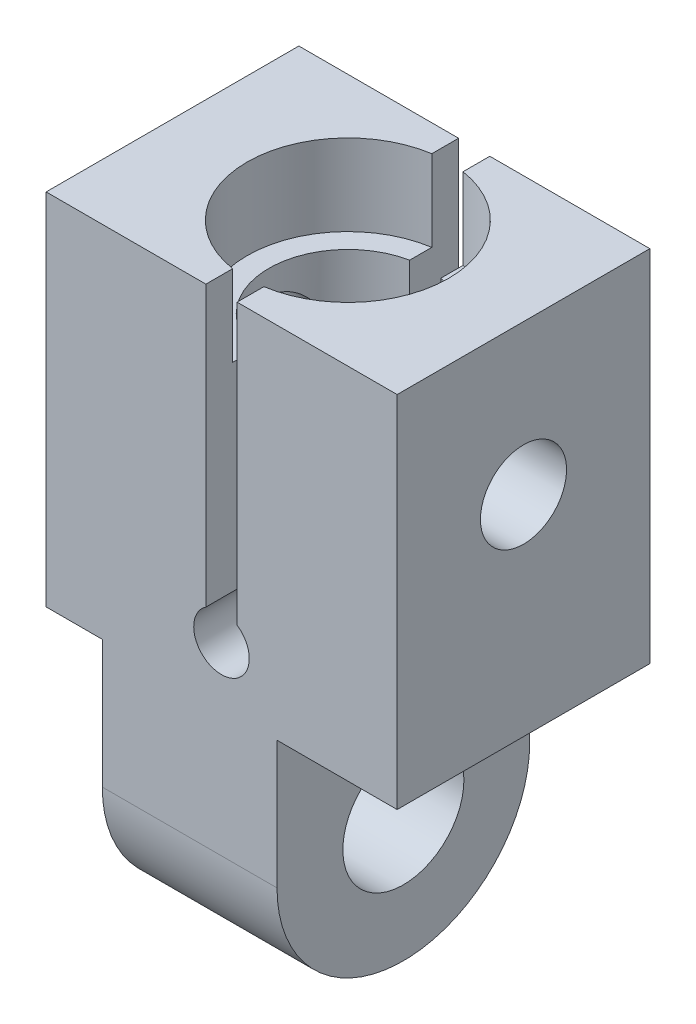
from build123d import *

# Parameters (mm, degrees)
SKETCH_1_R          = 2.4638
EXTRUDE_1_DEPTH     = 3.556
SKETCH_2_W          = 14.2875
SKETCH_2_H          = 10.287
EXTRUDE_2_DEPTH     = 14.6304
CUT_EXTRUDE_1_DEPTH = 24.88872705


with BuildPart() as part:
    # Sketch 1 → Extrude 1 (new, symmetric)
    with BuildSketch(Plane(origin=(0, 0, 0), x_dir=(0, 0, -1), z_dir=(1, 0, 0))):
        with BuildLine():
            Line((-5.1435, 0), (-5.1435, 5.207))
            Line((-5.1435, 5.207), (5.1435, 5.207))
            Line((5.1435, 5.207), (5.1435, 0))
            ThreePointArc((5.1435, 0), (0, -5.1435), (-5.1435, 0))
        make_face()
        Circle(SKETCH_1_R, mode=Mode.SUBTRACT)
    extrude(amount=EXTRUDE_1_DEPTH, both=True)

    # Sketch 2 → Extrude 2 (add)
    with BuildSketch(Plane(origin=(0, 5.207, 0), x_dir=(1, 0, 0), z_dir=(0, 1, 0))):
        with Locations((1.30175, 0)):
            Rectangle(SKETCH_2_W, SKETCH_2_H)
    extrude(amount=EXTRUDE_2_DEPTH)

    # Sketch 3 → Cut-Revolve 1 (revolve, cut)
    with BuildSketch(Plane(origin=(0, 0, 0), x_dir=(0, 0, -1), z_dir=(1, 0, 0))):
        Polygon((0, -5.1435), (2.667, -5.1435), (0, -3.603706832), align=None)
    revolve(axis=Axis((0, 0, 0), (0, -1, 0)), mode=Mode.SUBTRACT)

    # Sketch 4 → Cut-Extrude 1 (cut, through all)
    with BuildSketch(Plane.XY.offset(5.1435)):
        with BuildLine():
            Line((1.9304, 19.8374), (0.6604, 19.8374))
            Line((0.6604, 19.8374), (0.6604, 8.453468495))
            ThreePointArc((0.6604, 8.453468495), (1.2954, 6.3881), (1.9304, 8.453468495))
            Line((1.9304, 8.453468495), (1.9304, 19.8374))
        make_face()
    extrude(amount=-CUT_EXTRUDE_1_DEPTH, mode=Mode.SUBTRACT)

    # Sketch 6 → Cut-Revolve 2 (revolve, cut)
    with BuildSketch(Plane.XY):
        Polygon((-2.8067, 19.8374), (1.2954, 19.8374), (1.2954, 6.078188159), (-1.9177, 8.328025), (-1.9177, 16.5354), (-2.8067, 16.5354), align=None)
    revolve(axis=Axis((1.2954, 20.416711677, 0), (0, -1, 0)), mode=Mode.SUBTRACT)

    # Sketch 7 → Cut-Revolve 3 (revolve, cut)
    with BuildSketch(Plane.XY, mode=Mode.PRIVATE) as cut_revolve_3_sk:
        Polygon((8.4455, 13.7414), (8.4455, 15.494), (1.9304, 15.494), (1.9304, 15.5448), (-4.2545, 15.5448), (-4.2545, 16.9164), (-5.842, 16.9164), (-5.842, 13.7414), align=None)
    revolve(cut_revolve_3_sk.sketch.rotate(Axis((-9.424969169, 13.7414, 0), (1, 0, 0)), 90), axis=Axis((-9.424969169, 13.7414, 0), (1, 0, 0)), mode=Mode.SUBTRACT)


solid = part.part
